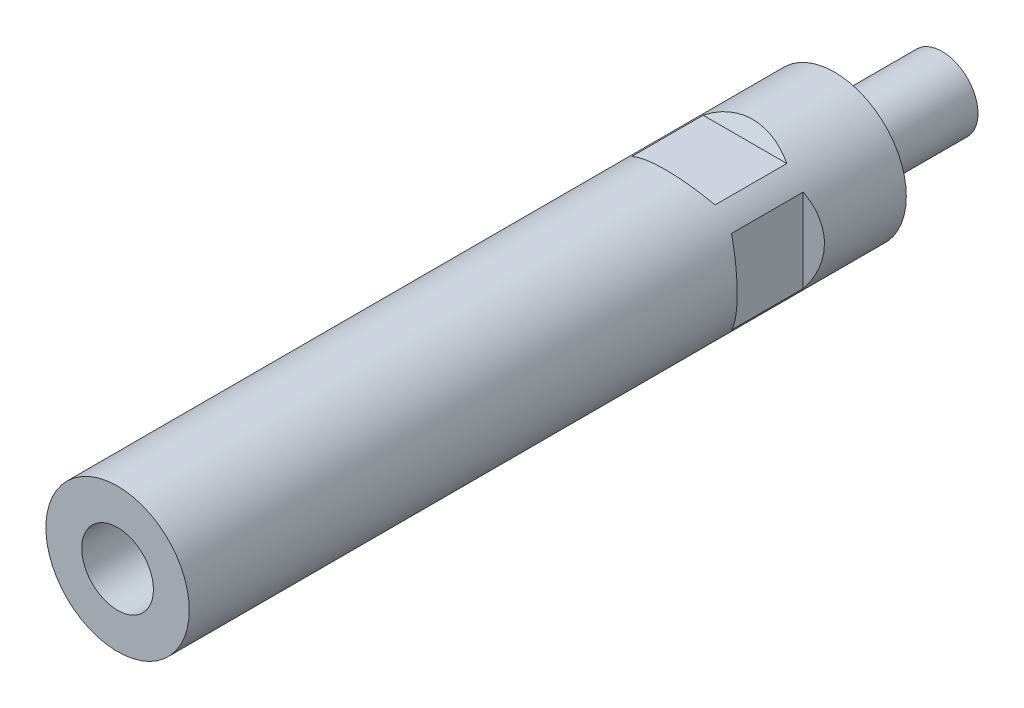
ISO-10303-21;
HEADER;
FILE_DESCRIPTION(('STEP AP214'),'2;1');
FILE_NAME('part.step','',(''),(''),'','','');
FILE_SCHEMA(('AUTOMOTIVE_DESIGN { 1 0 10303 214 1 1 1 1 }'));
ENDSEC;
DATA;
#1=APPLICATION_CONTEXT('core data for automotive mechanical design processes');
#2=APPLICATION_PROTOCOL_DEFINITION('international standard','automotive_design',2000,#1);
#3=PRODUCT_CONTEXT('',#1,'mechanical');
#4=PRODUCT('Part','Part','',(#3));
#5=PRODUCT_RELATED_PRODUCT_CATEGORY('part','',(#4));
#6=PRODUCT_DEFINITION_FORMATION('','',#4);
#7=PRODUCT_DEFINITION_CONTEXT('part definition',#1,'design');
#8=PRODUCT_DEFINITION('design','',#6,#7);
#9=PRODUCT_DEFINITION_SHAPE('','',#8);
#10=(LENGTH_UNIT() NAMED_UNIT(*) SI_UNIT(.MILLI.,.METRE.));
#11=(NAMED_UNIT(*) PLANE_ANGLE_UNIT() SI_UNIT($,.RADIAN.));
#12=(NAMED_UNIT(*) SI_UNIT($,.STERADIAN.) SOLID_ANGLE_UNIT());
#13=UNCERTAINTY_MEASURE_WITH_UNIT(LENGTH_MEASURE(1.E-05),#10,'distance_accuracy_value','');
#14=(GEOMETRIC_REPRESENTATION_CONTEXT(3) GLOBAL_UNCERTAINTY_ASSIGNED_CONTEXT((#13)) GLOBAL_UNIT_ASSIGNED_CONTEXT((#10,
#11,#12)) REPRESENTATION_CONTEXT('',''));
#15=CARTESIAN_POINT('',(0.,0.,0.));
#16=DIRECTION('',(0.,0.,1.));
#17=DIRECTION('',(1.,0.,0.));
#18=AXIS2_PLACEMENT_3D('',#15,#16,#17);
#19=CARTESIAN_POINT('',(0.,0.,8.));
#20=DIRECTION('',(0.,0.,1.));
#21=DIRECTION('',(0.,-1.,0.));
#22=AXIS2_PLACEMENT_3D('',#19,#20,#21);
#23=CYLINDRICAL_SURFACE('',#22,4.);
#24=CARTESIAN_POINT('',(0.,0.,-12.));
#25=DIRECTION('',(0.,0.,1.));
#26=DIRECTION('',(0.,-1.,0.));
#27=AXIS2_PLACEMENT_3D('',#24,#25,#26);
#28=CIRCLE('',#27,4.);
#29=CARTESIAN_POINT('',(0.,-4.,-12.));
#30=VERTEX_POINT('',#29);
#31=EDGE_CURVE('E22',#30,#30,#28,.F.);
#32=ORIENTED_EDGE('',*,*,#31,.F.);
#33=EDGE_LOOP('',(#32));
#34=FACE_BOUND('',#33,.T.);
#35=CARTESIAN_POINT('',(0.,0.,0.));
#36=DIRECTION('',(0.,0.,1.));
#37=DIRECTION('',(1.,0.,0.));
#38=AXIS2_PLACEMENT_3D('',#35,#36,#37);
#39=CIRCLE('',#38,4.);
#40=CARTESIAN_POINT('',(4.,0.,0.));
#41=VERTEX_POINT('',#40);
#42=EDGE_CURVE('E9',#41,#41,#39,.T.);
#43=ORIENTED_EDGE('',*,*,#42,.F.);
#44=EDGE_LOOP('',(#43));
#45=FACE_BOUND('',#44,.T.);
#46=ADVANCED_FACE('F14',(#34,#45),#23,.T.);
#47=CARTESIAN_POINT('',(0.,0.,-12.));
#48=DIRECTION('',(0.,0.,1.));
#49=DIRECTION('',(0.,-1.,0.));
#50=AXIS2_PLACEMENT_3D('',#47,#48,#49);
#51=PLANE('',#50);
#52=ORIENTED_EDGE('',*,*,#31,.T.);
#53=EDGE_LOOP('',(#52));
#54=FACE_BOUND('',#53,.T.);
#55=ADVANCED_FACE('F16',(#54),#51,.F.);
#56=CARTESIAN_POINT('',(3.4,0.,60.));
#57=DIRECTION('',(0.,0.,-1.));
#58=DIRECTION('',(-1.,0.,0.));
#59=AXIS2_PLACEMENT_3D('',#56,#57,#58);
#60=PLANE('',#59);
#61=CARTESIAN_POINT('',(0.,0.,60.));
#62=DIRECTION('',(0.,0.,1.));
#63=DIRECTION('',(1.,0.,0.));
#64=AXIS2_PLACEMENT_3D('',#61,#62,#63);
#65=CIRCLE('',#64,4.);
#66=CARTESIAN_POINT('',(4.,0.,60.));
#67=VERTEX_POINT('',#66);
#68=EDGE_CURVE('E251',#67,#67,#65,.T.);
#69=ORIENTED_EDGE('',*,*,#68,.T.);
#70=EDGE_LOOP('',(#69));
#71=FACE_BOUND('',#70,.T.);
#72=ADVANCED_FACE('F125',(#71),#60,.F.);
#73=CARTESIAN_POINT('',(0.,0.,80.));
#74=DIRECTION('',(0.,0.,1.));
#75=DIRECTION('',(1.,0.,0.));
#76=AXIS2_PLACEMENT_3D('',#73,#74,#75);
#77=CYLINDRICAL_SURFACE('',#76,4.);
#78=ORIENTED_EDGE('',*,*,#68,.F.);
#79=EDGE_LOOP('',(#78));
#80=FACE_BOUND('',#79,.T.);
#81=CARTESIAN_POINT('',(0.,0.,80.));
#82=DIRECTION('',(0.,0.,1.));
#83=DIRECTION('',(1.,0.,0.));
#84=AXIS2_PLACEMENT_3D('',#81,#82,#83);
#85=CIRCLE('',#84,4.);
#86=CARTESIAN_POINT('',(4.,0.,80.));
#87=VERTEX_POINT('',#86);
#88=EDGE_CURVE('E96',#87,#87,#85,.T.);
#89=ORIENTED_EDGE('',*,*,#88,.T.);
#90=EDGE_LOOP('',(#89));
#91=FACE_BOUND('',#90,.T.);
#92=ADVANCED_FACE('F127',(#80,#91),#77,.F.);
#93=CARTESIAN_POINT('',(0.,0.,80.));
#94=DIRECTION('',(0.,0.,1.));
#95=DIRECTION('',(1.,0.,0.));
#96=AXIS2_PLACEMENT_3D('',#93,#94,#95);
#97=PLANE('',#96);
#98=ORIENTED_EDGE('',*,*,#88,.F.);
#99=EDGE_LOOP('',(#98));
#100=FACE_BOUND('',#99,.T.);
#101=CARTESIAN_POINT('',(0.,0.,80.));
#102=DIRECTION('',(0.,0.,1.));
#103=DIRECTION('',(1.,0.,0.));
#104=AXIS2_PLACEMENT_3D('',#101,#102,#103);
#105=CIRCLE('',#104,8.);
#106=CARTESIAN_POINT('',(8.,0.,80.));
#107=VERTEX_POINT('',#106);
#108=EDGE_CURVE('E239',#107,#107,#105,.T.);
#109=ORIENTED_EDGE('',*,*,#108,.T.);
#110=EDGE_LOOP('',(#109));
#111=FACE_BOUND('',#110,.T.);
#112=ADVANCED_FACE('F134',(#100,#111),#97,.T.);
#113=CARTESIAN_POINT('',(6.5,-8.,18.));
#114=DIRECTION('',(-0.5,0.,0.86602540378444));
#115=DIRECTION('',(0.86602540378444,0.,0.5));
#116=AXIS2_PLACEMENT_3D('',#113,#114,#115);
#117=PLANE('',#116);
#118=DIRECTION('',(0.,1.,0.));
#119=VECTOR('',#118,1.);
#120=CARTESIAN_POINT('',(6.5,-8.,18.));
#121=LINE('',#120,#119);
#122=CARTESIAN_POINT('',(6.5,-4.66368952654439,18.));
#123=VERTEX_POINT('',#122);
#124=CARTESIAN_POINT('',(6.5,4.66368952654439,18.));
#125=VERTEX_POINT('',#124);
#126=EDGE_CURVE('E183',#123,#125,#121,.T.);
#127=ORIENTED_EDGE('',*,*,#126,.T.);
#128=CARTESIAN_POINT('',(0.,0.,14.2472232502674));
#129=DIRECTION('',(-0.5,0.,0.86602540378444));
#130=DIRECTION('',(-0.86602540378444,0.,-0.5));
#131=AXIS2_PLACEMENT_3D('',#128,#129,#130);
#132=ELLIPSE('',#131,9.237604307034,8.);
#133=EDGE_CURVE('E35',#123,#125,#132,.T.);
#134=ORIENTED_EDGE('',*,*,#133,.F.);
#135=EDGE_LOOP('',(#127,#134));
#136=FACE_BOUND('',#135,.T.);
#137=ADVANCED_FACE('F175',(#136),#117,.F.);
#138=CARTESIAN_POINT('',(6.5,-8.,18.));
#139=DIRECTION('',(-1.,0.,0.));
#140=DIRECTION('',(0.,0.,1.));
#141=AXIS2_PLACEMENT_3D('',#138,#139,#140);
#142=PLANE('',#141);
#143=ORIENTED_EDGE('',*,*,#126,.F.);
#144=DIRECTION('',(0.,0.,-1.));
#145=VECTOR('',#144,1.);
#146=CARTESIAN_POINT('',(6.5,-4.66368952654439,80.));
#147=LINE('',#146,#145);
#148=CARTESIAN_POINT('',(6.5,-4.66368952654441,10.));
#149=VERTEX_POINT('',#148);
#150=EDGE_CURVE('E191',#149,#123,#147,.F.);
#151=ORIENTED_EDGE('',*,*,#150,.F.);
#152=DIRECTION('',(0.,1.,0.));
#153=VECTOR('',#152,1.);
#154=CARTESIAN_POINT('',(6.5,-8.,10.));
#155=LINE('',#154,#153);
#156=CARTESIAN_POINT('',(6.5,4.6636895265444,10.));
#157=VERTEX_POINT('',#156);
#158=EDGE_CURVE('E187',#149,#157,#155,.T.);
#159=ORIENTED_EDGE('',*,*,#158,.T.);
#160=DIRECTION('',(0.,0.,-1.));
#161=VECTOR('',#160,1.);
#162=CARTESIAN_POINT('',(6.5,4.66368952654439,80.));
#163=LINE('',#162,#161);
#164=EDGE_CURVE('E29',#125,#157,#163,.T.);
#165=ORIENTED_EDGE('',*,*,#164,.F.);
#166=EDGE_LOOP('',(#143,#151,#159,#165));
#167=FACE_BOUND('',#166,.T.);
#168=ADVANCED_FACE('F172',(#167),#142,.F.);
#169=CARTESIAN_POINT('',(6.5,-8.,10.));
#170=DIRECTION('',(-0.5,0.,-0.866025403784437));
#171=DIRECTION('',(-0.866025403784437,0.,0.5));
#172=AXIS2_PLACEMENT_3D('',#169,#170,#171);
#173=PLANE('',#172);
#174=CARTESIAN_POINT('',(0.,0.,13.7527767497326));
#175=DIRECTION('',(-0.5,0.,-0.866025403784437));
#176=DIRECTION('',(0.866025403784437,0.,-0.5));
#177=AXIS2_PLACEMENT_3D('',#174,#175,#176);
#178=ELLIPSE('',#177,9.23760430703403,8.);
#179=EDGE_CURVE('E195',#157,#149,#178,.T.);
#180=ORIENTED_EDGE('',*,*,#179,.F.);
#181=ORIENTED_EDGE('',*,*,#158,.F.);
#182=EDGE_LOOP('',(#180,#181));
#183=FACE_BOUND('',#182,.T.);
#184=ADVANCED_FACE('F167',(#183),#173,.F.);
#185=CARTESIAN_POINT('',(-6.5,-8.,10.));
#186=DIRECTION('',(0.5,0.,-0.866025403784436));
#187=DIRECTION('',(-0.866025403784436,0.,-0.5));
#188=AXIS2_PLACEMENT_3D('',#185,#186,#187);
#189=PLANE('',#188);
#190=CARTESIAN_POINT('',(0.,0.,13.7527767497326));
#191=DIRECTION('',(0.5,0.,-0.866025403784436));
#192=DIRECTION('',(-0.866025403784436,0.,-0.5));
#193=AXIS2_PLACEMENT_3D('',#190,#191,#192);
#194=ELLIPSE('',#193,9.23760430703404,8.);
#195=CARTESIAN_POINT('',(-6.5,-4.66368952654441,10.));
#196=VERTEX_POINT('',#195);
#197=CARTESIAN_POINT('',(-6.5,4.6636895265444,10.));
#198=VERTEX_POINT('',#197);
#199=EDGE_CURVE('E193',#196,#198,#194,.T.);
#200=ORIENTED_EDGE('',*,*,#199,.F.);
#201=DIRECTION('',(0.,1.,0.));
#202=VECTOR('',#201,1.);
#203=CARTESIAN_POINT('',(-6.5,-8.,10.));
#204=LINE('',#203,#202);
#205=EDGE_CURVE('E227',#196,#198,#204,.T.);
#206=ORIENTED_EDGE('',*,*,#205,.T.);
#207=EDGE_LOOP('',(#200,#206));
#208=FACE_BOUND('',#207,.T.);
#209=ADVANCED_FACE('F163',(#208),#189,.F.);
#210=CARTESIAN_POINT('',(-6.5,-8.,18.));
#211=DIRECTION('',(0.5,0.,0.866025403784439));
#212=DIRECTION('',(0.866025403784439,0.,-0.5));
#213=AXIS2_PLACEMENT_3D('',#210,#211,#212);
#214=PLANE('',#213);
#215=DIRECTION('',(0.,1.,0.));
#216=VECTOR('',#215,1.);
#217=CARTESIAN_POINT('',(-6.5,-8.,18.));
#218=LINE('',#217,#216);
#219=CARTESIAN_POINT('',(-6.5,-4.66368952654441,18.));
#220=VERTEX_POINT('',#219);
#221=CARTESIAN_POINT('',(-6.5,4.66368952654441,18.));
#222=VERTEX_POINT('',#221);
#223=EDGE_CURVE('E231',#220,#222,#218,.T.);
#224=ORIENTED_EDGE('',*,*,#223,.F.);
#225=CARTESIAN_POINT('',(0.,0.,14.2472232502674));
#226=DIRECTION('',(0.5,0.,0.866025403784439));
#227=DIRECTION('',(0.866025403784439,0.,-0.5));
#228=AXIS2_PLACEMENT_3D('',#225,#226,#227);
#229=ELLIPSE('',#228,9.23760430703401,8.);
#230=EDGE_CURVE('E206',#222,#220,#229,.T.);
#231=ORIENTED_EDGE('',*,*,#230,.F.);
#232=EDGE_LOOP('',(#224,#231));
#233=FACE_BOUND('',#232,.T.);
#234=ADVANCED_FACE('F160',(#233),#214,.F.);
#235=CARTESIAN_POINT('',(-6.5,-8.,18.));
#236=DIRECTION('',(1.,0.,0.));
#237=DIRECTION('',(0.,0.,-1.));
#238=AXIS2_PLACEMENT_3D('',#235,#236,#237);
#239=PLANE('',#238);
#240=ORIENTED_EDGE('',*,*,#223,.T.);
#241=DIRECTION('',(0.,0.,-1.));
#242=VECTOR('',#241,1.);
#243=CARTESIAN_POINT('',(-6.5,4.66368952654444,80.));
#244=LINE('',#243,#242);
#245=EDGE_CURVE('E200',#198,#222,#244,.F.);
#246=ORIENTED_EDGE('',*,*,#245,.F.);
#247=ORIENTED_EDGE('',*,*,#205,.F.);
#248=DIRECTION('',(0.,0.,-1.));
#249=VECTOR('',#248,1.);
#250=CARTESIAN_POINT('',(-6.5,-4.66368952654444,80.));
#251=LINE('',#250,#249);
#252=EDGE_CURVE('E203',#220,#196,#251,.T.);
#253=ORIENTED_EDGE('',*,*,#252,.F.);
#254=EDGE_LOOP('',(#240,#246,#247,#253));
#255=FACE_BOUND('',#254,.T.);
#256=ADVANCED_FACE('F158',(#255),#239,.F.);
#257=CARTESIAN_POINT('',(8.,6.5,18.));
#258=DIRECTION('',(0.,-0.5,0.86602540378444));
#259=DIRECTION('',(0.,-0.86602540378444,-0.5));
#260=AXIS2_PLACEMENT_3D('',#257,#258,#259);
#261=PLANE('',#260);
#262=DIRECTION('',(-1.,0.,0.));
#263=VECTOR('',#262,1.);
#264=CARTESIAN_POINT('',(8.,6.5,18.));
#265=LINE('',#264,#263);
#266=CARTESIAN_POINT('',(4.66368952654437,6.5,18.));
#267=VERTEX_POINT('',#266);
#268=CARTESIAN_POINT('',(-4.66368952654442,6.5,18.));
#269=VERTEX_POINT('',#268);
#270=EDGE_CURVE('E225',#267,#269,#265,.T.);
#271=ORIENTED_EDGE('',*,*,#270,.T.);
#272=CARTESIAN_POINT('',(0.,0.,14.2472232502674));
#273=DIRECTION('',(0.,-0.5,0.86602540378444));
#274=DIRECTION('',(0.,-0.86602540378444,-0.5));
#275=AXIS2_PLACEMENT_3D('',#272,#273,#274);
#276=ELLIPSE('',#275,9.237604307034,8.);
#277=EDGE_CURVE('E214',#267,#269,#276,.T.);
#278=ORIENTED_EDGE('',*,*,#277,.F.);
#279=EDGE_LOOP('',(#271,#278));
#280=FACE_BOUND('',#279,.T.);
#281=ADVANCED_FACE('F151',(#280),#261,.F.);
#282=CARTESIAN_POINT('',(8.,6.5,18.));
#283=DIRECTION('',(0.,-1.,0.));
#284=DIRECTION('',(1.,0.,0.));
#285=AXIS2_PLACEMENT_3D('',#282,#283,#284);
#286=PLANE('',#285);
#287=ORIENTED_EDGE('',*,*,#270,.F.);
#288=DIRECTION('',(0.,0.,-1.));
#289=VECTOR('',#288,1.);
#290=CARTESIAN_POINT('',(4.66368952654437,6.5,80.));
#291=LINE('',#290,#289);
#292=CARTESIAN_POINT('',(4.66368952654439,6.5,10.));
#293=VERTEX_POINT('',#292);
#294=EDGE_CURVE('E88',#293,#267,#291,.F.);
#295=ORIENTED_EDGE('',*,*,#294,.F.);
#296=DIRECTION('',(-1.,0.,0.));
#297=VECTOR('',#296,1.);
#298=CARTESIAN_POINT('',(8.,6.5,10.));
#299=LINE('',#298,#297);
#300=CARTESIAN_POINT('',(-4.66368952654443,6.5,10.));
#301=VERTEX_POINT('',#300);
#302=EDGE_CURVE('E223',#293,#301,#299,.T.);
#303=ORIENTED_EDGE('',*,*,#302,.T.);
#304=DIRECTION('',(0.,0.,-1.));
#305=VECTOR('',#304,1.);
#306=CARTESIAN_POINT('',(-4.66368952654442,6.5,80.));
#307=LINE('',#306,#305);
#308=EDGE_CURVE('E211',#269,#301,#307,.T.);
#309=ORIENTED_EDGE('',*,*,#308,.F.);
#310=EDGE_LOOP('',(#287,#295,#303,#309));
#311=FACE_BOUND('',#310,.T.);
#312=ADVANCED_FACE('F148',(#311),#286,.F.);
#313=CARTESIAN_POINT('',(8.,6.5,10.));
#314=DIRECTION('',(0.,-0.5,-0.866025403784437));
#315=DIRECTION('',(0.,0.866025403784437,-0.5));
#316=AXIS2_PLACEMENT_3D('',#313,#314,#315);
#317=PLANE('',#316);
#318=CARTESIAN_POINT('',(0.,0.,13.7527767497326));
#319=DIRECTION('',(0.,-0.5,-0.866025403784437));
#320=DIRECTION('',(0.,0.866025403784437,-0.5));
#321=AXIS2_PLACEMENT_3D('',#318,#319,#320);
#322=ELLIPSE('',#321,9.23760430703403,8.);
#323=EDGE_CURVE('E209',#301,#293,#322,.T.);
#324=ORIENTED_EDGE('',*,*,#323,.F.);
#325=ORIENTED_EDGE('',*,*,#302,.F.);
#326=EDGE_LOOP('',(#324,#325));
#327=FACE_BOUND('',#326,.T.);
#328=ADVANCED_FACE('F145',(#327),#317,.F.);
#329=CARTESIAN_POINT('',(8.,-6.5,10.));
#330=DIRECTION('',(0.,0.5,-0.866025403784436));
#331=DIRECTION('',(0.,0.866025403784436,0.5));
#332=AXIS2_PLACEMENT_3D('',#329,#330,#331);
#333=PLANE('',#332);
#334=CARTESIAN_POINT('',(0.,0.,13.7527767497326));
#335=DIRECTION('',(0.,0.5,-0.866025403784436));
#336=DIRECTION('',(0.,-0.866025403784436,-0.5));
#337=AXIS2_PLACEMENT_3D('',#334,#335,#336);
#338=ELLIPSE('',#337,9.23760430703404,8.);
#339=CARTESIAN_POINT('',(4.66368952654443,-6.5,10.));
#340=VERTEX_POINT('',#339);
#341=CARTESIAN_POINT('',(-4.66368952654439,-6.5,10.));
#342=VERTEX_POINT('',#341);
#343=EDGE_CURVE('E79',#340,#342,#338,.T.);
#344=ORIENTED_EDGE('',*,*,#343,.F.);
#345=DIRECTION('',(-1.,0.,0.));
#346=VECTOR('',#345,1.);
#347=CARTESIAN_POINT('',(8.,-6.5,10.));
#348=LINE('',#347,#346);
#349=EDGE_CURVE('E82',#340,#342,#348,.T.);
#350=ORIENTED_EDGE('',*,*,#349,.T.);
#351=EDGE_LOOP('',(#344,#350));
#352=FACE_BOUND('',#351,.T.);
#353=ADVANCED_FACE('F81',(#352),#333,.F.);
#354=CARTESIAN_POINT('',(8.,-6.5,18.));
#355=DIRECTION('',(0.,0.5,0.866025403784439));
#356=DIRECTION('',(0.,-0.866025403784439,0.5));
#357=AXIS2_PLACEMENT_3D('',#354,#355,#356);
#358=PLANE('',#357);
#359=DIRECTION('',(-1.,0.,0.));
#360=VECTOR('',#359,1.);
#361=CARTESIAN_POINT('',(8.,-6.5,18.));
#362=LINE('',#361,#360);
#363=CARTESIAN_POINT('',(4.66368952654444,-6.5,18.));
#364=VERTEX_POINT('',#363);
#365=CARTESIAN_POINT('',(-4.6636895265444,-6.5,18.));
#366=VERTEX_POINT('',#365);
#367=EDGE_CURVE('E95',#364,#366,#362,.T.);
#368=ORIENTED_EDGE('',*,*,#367,.F.);
#369=CARTESIAN_POINT('',(0.,0.,14.2472232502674));
#370=DIRECTION('',(0.,0.5,0.866025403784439));
#371=DIRECTION('',(0.,0.866025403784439,-0.5));
#372=AXIS2_PLACEMENT_3D('',#369,#370,#371);
#373=ELLIPSE('',#372,9.23760430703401,8.);
#374=EDGE_CURVE('E101',#366,#364,#373,.T.);
#375=ORIENTED_EDGE('',*,*,#374,.F.);
#376=EDGE_LOOP('',(#368,#375));
#377=FACE_BOUND('',#376,.T.);
#378=ADVANCED_FACE('F139',(#377),#358,.F.);
#379=CARTESIAN_POINT('',(8.,-6.5,18.));
#380=DIRECTION('',(0.,1.,0.));
#381=DIRECTION('',(-1.,0.,0.));
#382=AXIS2_PLACEMENT_3D('',#379,#380,#381);
#383=PLANE('',#382);
#384=ORIENTED_EDGE('',*,*,#367,.T.);
#385=DIRECTION('',(0.,0.,-1.));
#386=VECTOR('',#385,1.);
#387=CARTESIAN_POINT('',(-4.66368952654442,-6.5,80.));
#388=LINE('',#387,#386);
#389=EDGE_CURVE('E87',#342,#366,#388,.F.);
#390=ORIENTED_EDGE('',*,*,#389,.F.);
#391=ORIENTED_EDGE('',*,*,#349,.F.);
#392=DIRECTION('',(0.,0.,-1.));
#393=VECTOR('',#392,1.);
#394=CARTESIAN_POINT('',(4.66368952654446,-6.5,80.));
#395=LINE('',#394,#393);
#396=EDGE_CURVE('E93',#364,#340,#395,.T.);
#397=ORIENTED_EDGE('',*,*,#396,.F.);
#398=EDGE_LOOP('',(#384,#390,#391,#397));
#399=FACE_BOUND('',#398,.T.);
#400=ADVANCED_FACE('F92',(#399),#383,.F.);
#401=CARTESIAN_POINT('',(0.,0.,80.));
#402=DIRECTION('',(0.,0.,-1.));
#403=DIRECTION('',(-1.,0.,0.));
#404=AXIS2_PLACEMENT_3D('',#401,#402,#403);
#405=CYLINDRICAL_SURFACE('',#404,8.);
#406=ORIENTED_EDGE('',*,*,#389,.T.);
#407=ORIENTED_EDGE('',*,*,#374,.T.);
#408=ORIENTED_EDGE('',*,*,#396,.T.);
#409=ORIENTED_EDGE('',*,*,#343,.T.);
#410=EDGE_LOOP('',(#406,#407,#408,#409));
#411=FACE_BOUND('',#410,.T.);
#412=ORIENTED_EDGE('',*,*,#323,.T.);
#413=ORIENTED_EDGE('',*,*,#294,.T.);
#414=ORIENTED_EDGE('',*,*,#277,.T.);
#415=ORIENTED_EDGE('',*,*,#308,.T.);
#416=EDGE_LOOP('',(#412,#413,#414,#415));
#417=FACE_BOUND('',#416,.T.);
#418=ORIENTED_EDGE('',*,*,#245,.T.);
#419=ORIENTED_EDGE('',*,*,#230,.T.);
#420=ORIENTED_EDGE('',*,*,#252,.T.);
#421=ORIENTED_EDGE('',*,*,#199,.T.);
#422=EDGE_LOOP('',(#418,#419,#420,#421));
#423=FACE_BOUND('',#422,.T.);
#424=ORIENTED_EDGE('',*,*,#179,.T.);
#425=ORIENTED_EDGE('',*,*,#150,.T.);
#426=ORIENTED_EDGE('',*,*,#133,.T.);
#427=ORIENTED_EDGE('',*,*,#164,.T.);
#428=EDGE_LOOP('',(#424,#425,#426,#427));
#429=FACE_BOUND('',#428,.T.);
#430=ORIENTED_EDGE('',*,*,#108,.F.);
#431=EDGE_LOOP('',(#430));
#432=FACE_BOUND('',#431,.T.);
#433=CARTESIAN_POINT('',(0.,0.,0.));
#434=DIRECTION('',(0.,0.,1.));
#435=DIRECTION('',(1.,0.,0.));
#436=AXIS2_PLACEMENT_3D('',#433,#434,#435);
#437=CIRCLE('',#436,8.);
#438=CARTESIAN_POINT('',(8.,0.,0.));
#439=VERTEX_POINT('',#438);
#440=EDGE_CURVE('E186',#439,#439,#437,.T.);
#441=ORIENTED_EDGE('',*,*,#440,.T.);
#442=EDGE_LOOP('',(#441));
#443=FACE_BOUND('',#442,.T.);
#444=ADVANCED_FACE('F99',(#411,#417,#423,#429,#432,#443),#405,.T.);
#445=CARTESIAN_POINT('',(0.,0.,0.));
#446=DIRECTION('',(0.,0.,1.));
#447=DIRECTION('',(1.,0.,0.));
#448=AXIS2_PLACEMENT_3D('',#445,#446,#447);
#449=PLANE('',#448);
#450=ORIENTED_EDGE('',*,*,#440,.F.);
#451=EDGE_LOOP('',(#450));
#452=FACE_BOUND('',#451,.T.);
#453=ORIENTED_EDGE('',*,*,#42,.T.);
#454=EDGE_LOOP('',(#453));
#455=FACE_BOUND('',#454,.T.);
#456=ADVANCED_FACE('F111',(#452,#455),#449,.F.);
#457=CLOSED_SHELL('',(#46,#55,#72,#92,#112,#137,#168,#184,#209,#234,#256,#281,#312,#328,#353,
#378,#400,#444,#456));
#458=MANIFOLD_SOLID_BREP('B1',#457);
#459=ADVANCED_BREP_SHAPE_REPRESENTATION('',(#18,#458),#14);
#460=SHAPE_DEFINITION_REPRESENTATION(#9,#459);
ENDSEC;
END-ISO-10303-21;
